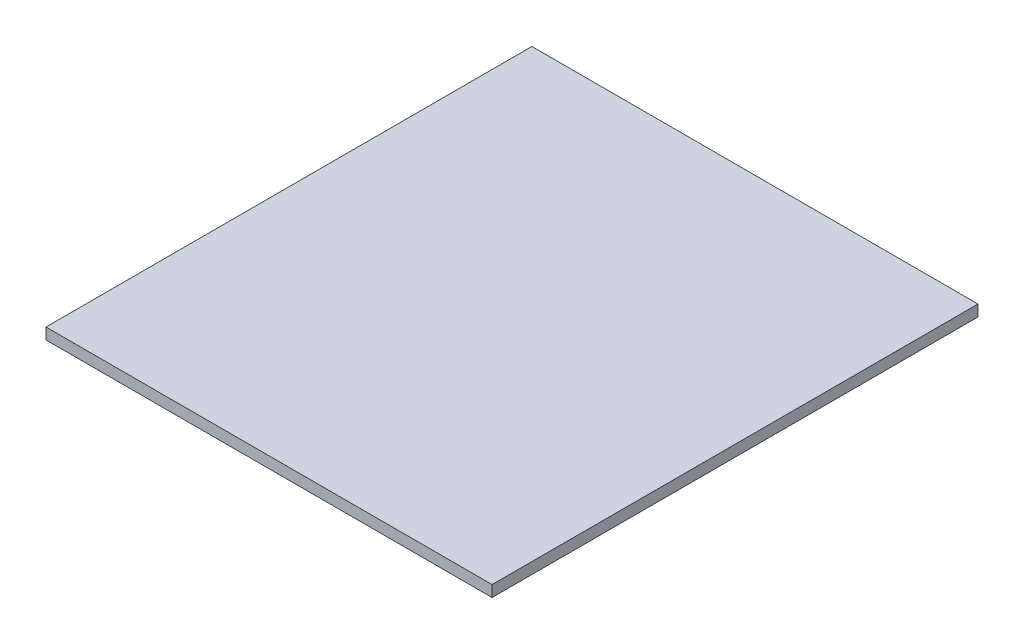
ISO-10303-21;
HEADER;
FILE_DESCRIPTION(('STEP AP214'),'2;1');
FILE_NAME('part.step','',(''),(''),'','','');
FILE_SCHEMA(('AUTOMOTIVE_DESIGN { 1 0 10303 214 1 1 1 1 }'));
ENDSEC;
DATA;
#1=APPLICATION_CONTEXT('core data for automotive mechanical design processes');
#2=APPLICATION_PROTOCOL_DEFINITION('international standard','automotive_design',2000,#1);
#3=PRODUCT_CONTEXT('',#1,'mechanical');
#4=PRODUCT('Part','Part','',(#3));
#5=PRODUCT_RELATED_PRODUCT_CATEGORY('part','',(#4));
#6=PRODUCT_DEFINITION_FORMATION('','',#4);
#7=PRODUCT_DEFINITION_CONTEXT('part definition',#1,'design');
#8=PRODUCT_DEFINITION('design','',#6,#7);
#9=PRODUCT_DEFINITION_SHAPE('','',#8);
#10=(LENGTH_UNIT() NAMED_UNIT(*) SI_UNIT(.MILLI.,.METRE.));
#11=(NAMED_UNIT(*) PLANE_ANGLE_UNIT() SI_UNIT($,.RADIAN.));
#12=(NAMED_UNIT(*) SI_UNIT($,.STERADIAN.) SOLID_ANGLE_UNIT());
#13=UNCERTAINTY_MEASURE_WITH_UNIT(LENGTH_MEASURE(1.E-05),#10,'distance_accuracy_value','');
#14=(GEOMETRIC_REPRESENTATION_CONTEXT(3) GLOBAL_UNCERTAINTY_ASSIGNED_CONTEXT((#13)) GLOBAL_UNIT_ASSIGNED_CONTEXT((#10,
#11,#12)) REPRESENTATION_CONTEXT('',''));
#15=CARTESIAN_POINT('',(0.,0.,0.));
#16=DIRECTION('',(0.,0.,1.));
#17=DIRECTION('',(1.,0.,0.));
#18=AXIS2_PLACEMENT_3D('',#15,#16,#17);
#19=CARTESIAN_POINT('',(-39.75,2.,43.3));
#20=DIRECTION('',(1.,0.,0.));
#21=DIRECTION('',(0.,0.,-1.));
#22=AXIS2_PLACEMENT_3D('',#19,#20,#21);
#23=PLANE('',#22);
#24=DIRECTION('',(0.,0.,1.));
#25=VECTOR('',#24,1.);
#26=CARTESIAN_POINT('',(-39.75,0.,43.3));
#27=LINE('',#26,#25);
#28=CARTESIAN_POINT('',(-39.75,0.,-43.3));
#29=VERTEX_POINT('',#28);
#30=CARTESIAN_POINT('',(-39.75,0.,43.3));
#31=VERTEX_POINT('',#30);
#32=EDGE_CURVE('E98',#29,#31,#27,.T.);
#33=ORIENTED_EDGE('',*,*,#32,.T.);
#34=DIRECTION('',(0.,-1.,0.));
#35=VECTOR('',#34,1.);
#36=CARTESIAN_POINT('',(-39.75,2.,43.3));
#37=LINE('',#36,#35);
#38=CARTESIAN_POINT('',(-39.75,2.,43.3));
#39=VERTEX_POINT('',#38);
#40=EDGE_CURVE('E11',#39,#31,#37,.T.);
#41=ORIENTED_EDGE('',*,*,#40,.F.);
#42=DIRECTION('',(0.,0.,1.));
#43=VECTOR('',#42,1.);
#44=CARTESIAN_POINT('',(-39.75,2.,43.3));
#45=LINE('',#44,#43);
#46=CARTESIAN_POINT('',(-39.75,2.,-43.3));
#47=VERTEX_POINT('',#46);
#48=EDGE_CURVE('E86',#47,#39,#45,.T.);
#49=ORIENTED_EDGE('',*,*,#48,.F.);
#50=DIRECTION('',(0.,-1.,0.));
#51=VECTOR('',#50,1.);
#52=CARTESIAN_POINT('',(-39.75,2.,-43.3));
#53=LINE('',#52,#51);
#54=EDGE_CURVE('E94',#47,#29,#53,.T.);
#55=ORIENTED_EDGE('',*,*,#54,.T.);
#56=EDGE_LOOP('',(#33,#41,#49,#55));
#57=FACE_BOUND('',#56,.T.);
#58=ADVANCED_FACE('F35',(#57),#23,.F.);
#59=CARTESIAN_POINT('',(39.75,2.,43.3));
#60=DIRECTION('',(0.,0.,-1.));
#61=DIRECTION('',(-1.,0.,0.));
#62=AXIS2_PLACEMENT_3D('',#59,#60,#61);
#63=PLANE('',#62);
#64=DIRECTION('',(1.,0.,0.));
#65=VECTOR('',#64,1.);
#66=CARTESIAN_POINT('',(39.75,0.,43.3));
#67=LINE('',#66,#65);
#68=CARTESIAN_POINT('',(39.75,0.,43.3));
#69=VERTEX_POINT('',#68);
#70=EDGE_CURVE('E90',#31,#69,#67,.T.);
#71=ORIENTED_EDGE('',*,*,#70,.T.);
#72=DIRECTION('',(0.,-1.,0.));
#73=VECTOR('',#72,1.);
#74=CARTESIAN_POINT('',(39.75,2.,43.3));
#75=LINE('',#74,#73);
#76=CARTESIAN_POINT('',(39.75,2.,43.3));
#77=VERTEX_POINT('',#76);
#78=EDGE_CURVE('E43',#77,#69,#75,.T.);
#79=ORIENTED_EDGE('',*,*,#78,.F.);
#80=DIRECTION('',(1.,0.,0.));
#81=VECTOR('',#80,1.);
#82=CARTESIAN_POINT('',(39.75,2.,43.3));
#83=LINE('',#82,#81);
#84=EDGE_CURVE('E81',#39,#77,#83,.T.);
#85=ORIENTED_EDGE('',*,*,#84,.F.);
#86=ORIENTED_EDGE('',*,*,#40,.T.);
#87=EDGE_LOOP('',(#71,#79,#85,#86));
#88=FACE_BOUND('',#87,.T.);
#89=ADVANCED_FACE('F89',(#88),#63,.F.);
#90=CARTESIAN_POINT('',(39.75,2.,43.3));
#91=DIRECTION('',(-1.,0.,0.));
#92=DIRECTION('',(0.,0.,1.));
#93=AXIS2_PLACEMENT_3D('',#90,#91,#92);
#94=PLANE('',#93);
#95=DIRECTION('',(0.,0.,-1.));
#96=VECTOR('',#95,1.);
#97=CARTESIAN_POINT('',(39.75,0.,43.3));
#98=LINE('',#97,#96);
#99=CARTESIAN_POINT('',(39.75,0.,-43.3));
#100=VERTEX_POINT('',#99);
#101=EDGE_CURVE('E68',#69,#100,#98,.T.);
#102=ORIENTED_EDGE('',*,*,#101,.T.);
#103=DIRECTION('',(0.,-1.,0.));
#104=VECTOR('',#103,1.);
#105=CARTESIAN_POINT('',(39.75,2.,-43.3));
#106=LINE('',#105,#104);
#107=CARTESIAN_POINT('',(39.75,2.,-43.3));
#108=VERTEX_POINT('',#107);
#109=EDGE_CURVE('E91',#108,#100,#106,.T.);
#110=ORIENTED_EDGE('',*,*,#109,.F.);
#111=DIRECTION('',(0.,0.,-1.));
#112=VECTOR('',#111,1.);
#113=CARTESIAN_POINT('',(39.75,2.,43.3));
#114=LINE('',#113,#112);
#115=EDGE_CURVE('E84',#77,#108,#114,.T.);
#116=ORIENTED_EDGE('',*,*,#115,.F.);
#117=ORIENTED_EDGE('',*,*,#78,.T.);
#118=EDGE_LOOP('',(#102,#110,#116,#117));
#119=FACE_BOUND('',#118,.T.);
#120=ADVANCED_FACE('F92',(#119),#94,.F.);
#121=CARTESIAN_POINT('',(39.75,2.,-43.3));
#122=DIRECTION('',(0.,0.,1.));
#123=DIRECTION('',(1.,0.,0.));
#124=AXIS2_PLACEMENT_3D('',#121,#122,#123);
#125=PLANE('',#124);
#126=DIRECTION('',(-1.,0.,0.));
#127=VECTOR('',#126,1.);
#128=CARTESIAN_POINT('',(39.75,0.,-43.3));
#129=LINE('',#128,#127);
#130=EDGE_CURVE('E74',#100,#29,#129,.T.);
#131=ORIENTED_EDGE('',*,*,#130,.T.);
#132=ORIENTED_EDGE('',*,*,#54,.F.);
#133=DIRECTION('',(-1.,0.,0.));
#134=VECTOR('',#133,1.);
#135=CARTESIAN_POINT('',(39.75,2.,-43.3));
#136=LINE('',#135,#134);
#137=EDGE_CURVE('E51',#108,#47,#136,.T.);
#138=ORIENTED_EDGE('',*,*,#137,.F.);
#139=ORIENTED_EDGE('',*,*,#109,.T.);
#140=EDGE_LOOP('',(#131,#132,#138,#139));
#141=FACE_BOUND('',#140,.T.);
#142=ADVANCED_FACE('F105',(#141),#125,.F.);
#143=CARTESIAN_POINT('',(0.,2.,0.));
#144=DIRECTION('',(0.,1.,0.));
#145=DIRECTION('',(0.,0.,1.));
#146=AXIS2_PLACEMENT_3D('',#143,#144,#145);
#147=PLANE('',#146);
#148=ORIENTED_EDGE('',*,*,#48,.T.);
#149=ORIENTED_EDGE('',*,*,#84,.T.);
#150=ORIENTED_EDGE('',*,*,#115,.T.);
#151=ORIENTED_EDGE('',*,*,#137,.T.);
#152=EDGE_LOOP('',(#148,#149,#150,#151));
#153=FACE_BOUND('',#152,.T.);
#154=ADVANCED_FACE('F82',(#153),#147,.T.);
#155=CARTESIAN_POINT('',(0.,0.,0.));
#156=DIRECTION('',(0.,1.,0.));
#157=DIRECTION('',(0.,0.,1.));
#158=AXIS2_PLACEMENT_3D('',#155,#156,#157);
#159=PLANE('',#158);
#160=ORIENTED_EDGE('',*,*,#32,.F.);
#161=ORIENTED_EDGE('',*,*,#130,.F.);
#162=ORIENTED_EDGE('',*,*,#101,.F.);
#163=ORIENTED_EDGE('',*,*,#70,.F.);
#164=EDGE_LOOP('',(#160,#161,#162,#163));
#165=FACE_BOUND('',#164,.T.);
#166=ADVANCED_FACE('F108',(#165),#159,.F.);
#167=CLOSED_SHELL('',(#58,#89,#120,#142,#154,#166));
#168=MANIFOLD_SOLID_BREP('B2',#167);
#169=ADVANCED_BREP_SHAPE_REPRESENTATION('',(#18,#168),#14);
#170=SHAPE_DEFINITION_REPRESENTATION(#9,#169);
ENDSEC;
END-ISO-10303-21;
